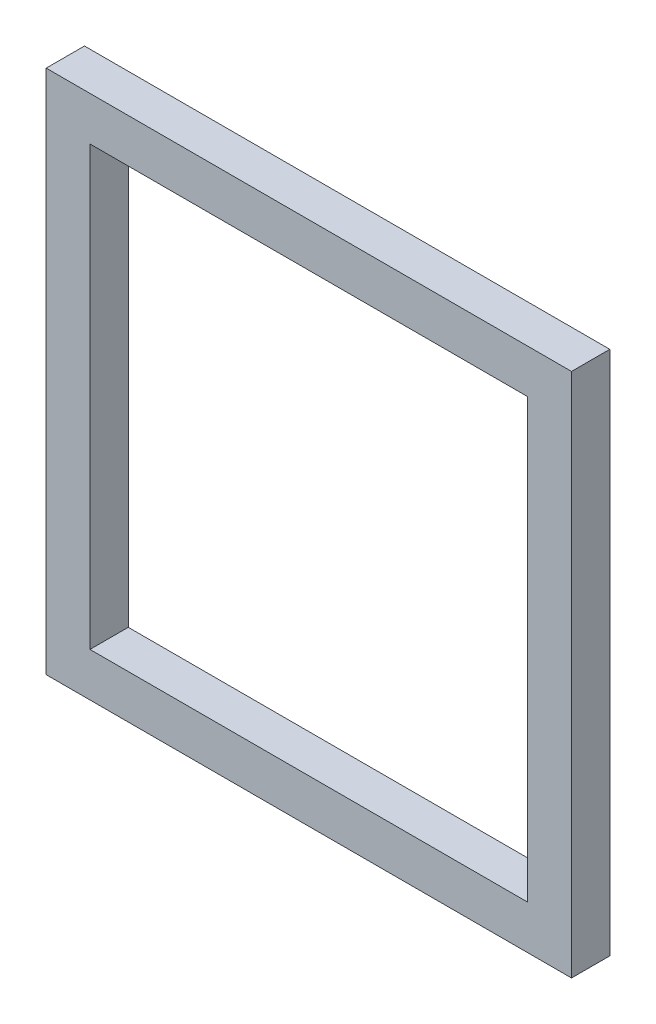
ISO-10303-21;
HEADER;
FILE_DESCRIPTION(('STEP AP214'),'2;1');
FILE_NAME('part.step','',(''),(''),'','','');
FILE_SCHEMA(('AUTOMOTIVE_DESIGN { 1 0 10303 214 1 1 1 1 }'));
ENDSEC;
DATA;
#1=APPLICATION_CONTEXT('core data for automotive mechanical design processes');
#2=APPLICATION_PROTOCOL_DEFINITION('international standard','automotive_design',2000,#1);
#3=PRODUCT_CONTEXT('',#1,'mechanical');
#4=PRODUCT('Part','Part','',(#3));
#5=PRODUCT_RELATED_PRODUCT_CATEGORY('part','',(#4));
#6=PRODUCT_DEFINITION_FORMATION('','',#4);
#7=PRODUCT_DEFINITION_CONTEXT('part definition',#1,'design');
#8=PRODUCT_DEFINITION('design','',#6,#7);
#9=PRODUCT_DEFINITION_SHAPE('','',#8);
#10=(LENGTH_UNIT() NAMED_UNIT(*) SI_UNIT(.MILLI.,.METRE.));
#11=(NAMED_UNIT(*) PLANE_ANGLE_UNIT() SI_UNIT($,.RADIAN.));
#12=(NAMED_UNIT(*) SI_UNIT($,.STERADIAN.) SOLID_ANGLE_UNIT());
#13=UNCERTAINTY_MEASURE_WITH_UNIT(LENGTH_MEASURE(1.E-05),#10,'distance_accuracy_value','');
#14=(GEOMETRIC_REPRESENTATION_CONTEXT(3) GLOBAL_UNCERTAINTY_ASSIGNED_CONTEXT((#13)) GLOBAL_UNIT_ASSIGNED_CONTEXT((#10,
#11,#12)) REPRESENTATION_CONTEXT('',''));
#15=CARTESIAN_POINT('',(0.,0.,0.));
#16=DIRECTION('',(0.,0.,1.));
#17=DIRECTION('',(1.,0.,0.));
#18=AXIS2_PLACEMENT_3D('',#15,#16,#17);
#19=CARTESIAN_POINT('',(700.,1000.,35.));
#20=DIRECTION('',(0.,-1.,0.));
#21=DIRECTION('',(0.,0.,-1.));
#22=AXIS2_PLACEMENT_3D('',#19,#20,#21);
#23=PLANE('',#22);
#24=CARTESIAN_POINT('',(300.,1000.,35.));
#25=DIRECTION('',(0.,0.,-1.));
#26=VECTOR('',#25,1.);
#27=LINE('',#24,#26);
#28=CARTESIAN_POINT('',(300.,1000.,35.));
#29=VERTEX_POINT('',#28);
#30=CARTESIAN_POINT('',(300.,1000.,0.));
#31=VERTEX_POINT('',#30);
#32=EDGE_CURVE('E12',#29,#31,#27,.T.);
#33=ORIENTED_EDGE('',*,*,#32,.F.);
#34=DIRECTION('',(-1.,0.,0.));
#35=VECTOR('',#34,1.);
#36=CARTESIAN_POINT('',(700.,1000.,35.));
#37=LINE('',#36,#35);
#38=CARTESIAN_POINT('',(700.,1000.,35.));
#39=VERTEX_POINT('',#38);
#40=EDGE_CURVE('E131',#39,#29,#37,.T.);
#41=ORIENTED_EDGE('',*,*,#40,.F.);
#42=DIRECTION('',(0.,0.,1.));
#43=VECTOR('',#42,1.);
#44=CARTESIAN_POINT('',(700.,1000.,35.));
#45=LINE('',#44,#43);
#46=CARTESIAN_POINT('',(700.,1000.,0.));
#47=VERTEX_POINT('',#46);
#48=EDGE_CURVE('E209',#47,#39,#45,.T.);
#49=ORIENTED_EDGE('',*,*,#48,.F.);
#50=DIRECTION('',(-1.,0.,0.));
#51=VECTOR('',#50,1.);
#52=CARTESIAN_POINT('',(700.,1000.,0.));
#53=LINE('',#52,#51);
#54=EDGE_CURVE('E124',#47,#31,#53,.T.);
#55=ORIENTED_EDGE('',*,*,#54,.T.);
#56=EDGE_LOOP('',(#33,#41,#49,#55));
#57=FACE_BOUND('',#56,.T.);
#58=ADVANCED_FACE('F36',(#57),#23,.F.);
#59=CARTESIAN_POINT('',(740.,960.,35.));
#60=DIRECTION('',(0.,1.,0.));
#61=DIRECTION('',(0.,0.,1.));
#62=AXIS2_PLACEMENT_3D('',#59,#60,#61);
#63=PLANE('',#62);
#64=CARTESIAN_POINT('',(260.,960.,0.));
#65=DIRECTION('',(0.,0.,1.));
#66=VECTOR('',#65,1.);
#67=LINE('',#64,#66);
#68=CARTESIAN_POINT('',(260.,960.,0.));
#69=VERTEX_POINT('',#68);
#70=CARTESIAN_POINT('',(260.,960.,35.));
#71=VERTEX_POINT('',#70);
#72=EDGE_CURVE('E46',#69,#71,#67,.T.);
#73=ORIENTED_EDGE('',*,*,#72,.F.);
#74=DIRECTION('',(-1.,0.,0.));
#75=VECTOR('',#74,1.);
#76=CARTESIAN_POINT('',(740.,960.,0.));
#77=LINE('',#76,#75);
#78=CARTESIAN_POINT('',(740.,960.,0.));
#79=VERTEX_POINT('',#78);
#80=EDGE_CURVE('E130',#79,#69,#77,.T.);
#81=ORIENTED_EDGE('',*,*,#80,.F.);
#82=DIRECTION('',(0.,0.,-1.));
#83=VECTOR('',#82,1.);
#84=CARTESIAN_POINT('',(740.,960.,35.));
#85=LINE('',#84,#83);
#86=CARTESIAN_POINT('',(740.,960.,35.));
#87=VERTEX_POINT('',#86);
#88=EDGE_CURVE('E128',#87,#79,#85,.T.);
#89=ORIENTED_EDGE('',*,*,#88,.F.);
#90=DIRECTION('',(-1.,0.,0.));
#91=VECTOR('',#90,1.);
#92=CARTESIAN_POINT('',(740.,960.,35.));
#93=LINE('',#92,#91);
#94=EDGE_CURVE('E107',#87,#71,#93,.T.);
#95=ORIENTED_EDGE('',*,*,#94,.T.);
#96=EDGE_LOOP('',(#73,#81,#89,#95));
#97=FACE_BOUND('',#96,.T.);
#98=ADVANCED_FACE('F38',(#97),#63,.F.);
#99=CARTESIAN_POINT('',(740.,1440.,35.));
#100=DIRECTION('',(1.,0.,0.));
#101=DIRECTION('',(0.,1.,0.));
#102=AXIS2_PLACEMENT_3D('',#99,#100,#101);
#103=PLANE('',#102);
#104=DIRECTION('',(0.,-1.,0.));
#105=VECTOR('',#104,1.);
#106=CARTESIAN_POINT('',(740.,1440.,35.));
#107=LINE('',#106,#105);
#108=CARTESIAN_POINT('',(740.,1440.,35.));
#109=VERTEX_POINT('',#108);
#110=EDGE_CURVE('E233',#109,#87,#107,.T.);
#111=ORIENTED_EDGE('',*,*,#110,.T.);
#112=ORIENTED_EDGE('',*,*,#88,.T.);
#113=DIRECTION('',(0.,-1.,0.));
#114=VECTOR('',#113,1.);
#115=CARTESIAN_POINT('',(740.,1440.,0.));
#116=LINE('',#115,#114);
#117=CARTESIAN_POINT('',(740.,1440.,0.));
#118=VERTEX_POINT('',#117);
#119=EDGE_CURVE('E230',#118,#79,#116,.T.);
#120=ORIENTED_EDGE('',*,*,#119,.F.);
#121=DIRECTION('',(0.,0.,1.));
#122=VECTOR('',#121,1.);
#123=CARTESIAN_POINT('',(740.,1440.,35.));
#124=LINE('',#123,#122);
#125=EDGE_CURVE('E237',#118,#109,#124,.T.);
#126=ORIENTED_EDGE('',*,*,#125,.T.);
#127=EDGE_LOOP('',(#111,#112,#120,#126));
#128=FACE_BOUND('',#127,.T.);
#129=ADVANCED_FACE('F183',(#128),#103,.T.);
#130=CARTESIAN_POINT('',(700.,1400.,35.));
#131=DIRECTION('',(-1.,0.,0.));
#132=DIRECTION('',(0.,-1.,0.));
#133=AXIS2_PLACEMENT_3D('',#130,#131,#132);
#134=PLANE('',#133);
#135=DIRECTION('',(0.,-1.,0.));
#136=VECTOR('',#135,1.);
#137=CARTESIAN_POINT('',(700.,1400.,0.));
#138=LINE('',#137,#136);
#139=CARTESIAN_POINT('',(700.,1400.,0.));
#140=VERTEX_POINT('',#139);
#141=EDGE_CURVE('E212',#140,#47,#138,.T.);
#142=ORIENTED_EDGE('',*,*,#141,.T.);
#143=ORIENTED_EDGE('',*,*,#48,.T.);
#144=DIRECTION('',(0.,-1.,0.));
#145=VECTOR('',#144,1.);
#146=CARTESIAN_POINT('',(700.,1400.,35.));
#147=LINE('',#146,#145);
#148=CARTESIAN_POINT('',(700.,1400.,35.));
#149=VERTEX_POINT('',#148);
#150=EDGE_CURVE('E225',#149,#39,#147,.T.);
#151=ORIENTED_EDGE('',*,*,#150,.F.);
#152=DIRECTION('',(0.,0.,-1.));
#153=VECTOR('',#152,1.);
#154=CARTESIAN_POINT('',(700.,1400.,35.));
#155=LINE('',#154,#153);
#156=EDGE_CURVE('E235',#149,#140,#155,.T.);
#157=ORIENTED_EDGE('',*,*,#156,.T.);
#158=EDGE_LOOP('',(#142,#143,#151,#157));
#159=FACE_BOUND('',#158,.T.);
#160=ADVANCED_FACE('F178',(#159),#134,.T.);
#161=CARTESIAN_POINT('',(260.,1440.,35.));
#162=DIRECTION('',(0.,-1.,0.));
#163=DIRECTION('',(0.,0.,-1.));
#164=AXIS2_PLACEMENT_3D('',#161,#162,#163);
#165=PLANE('',#164);
#166=ORIENTED_EDGE('',*,*,#125,.F.);
#167=DIRECTION('',(1.,0.,0.));
#168=VECTOR('',#167,1.);
#169=CARTESIAN_POINT('',(260.,1440.,0.));
#170=LINE('',#169,#168);
#171=CARTESIAN_POINT('',(260.,1440.,0.));
#172=VERTEX_POINT('',#171);
#173=EDGE_CURVE('E240',#172,#118,#170,.T.);
#174=ORIENTED_EDGE('',*,*,#173,.F.);
#175=DIRECTION('',(0.,0.,-1.));
#176=VECTOR('',#175,1.);
#177=CARTESIAN_POINT('',(260.,1440.,35.));
#178=LINE('',#177,#176);
#179=CARTESIAN_POINT('',(260.,1440.,35.));
#180=VERTEX_POINT('',#179);
#181=EDGE_CURVE('E114',#180,#172,#178,.T.);
#182=ORIENTED_EDGE('',*,*,#181,.F.);
#183=DIRECTION('',(1.,0.,0.));
#184=VECTOR('',#183,1.);
#185=CARTESIAN_POINT('',(260.,1440.,35.));
#186=LINE('',#185,#184);
#187=EDGE_CURVE('E110',#180,#109,#186,.T.);
#188=ORIENTED_EDGE('',*,*,#187,.T.);
#189=EDGE_LOOP('',(#166,#174,#182,#188));
#190=FACE_BOUND('',#189,.T.);
#191=ADVANCED_FACE('F167',(#190),#165,.F.);
#192=CARTESIAN_POINT('',(300.,1400.,35.));
#193=DIRECTION('',(0.,1.,0.));
#194=DIRECTION('',(0.,0.,1.));
#195=AXIS2_PLACEMENT_3D('',#192,#193,#194);
#196=PLANE('',#195);
#197=ORIENTED_EDGE('',*,*,#156,.F.);
#198=DIRECTION('',(1.,0.,0.));
#199=VECTOR('',#198,1.);
#200=CARTESIAN_POINT('',(300.,1400.,35.));
#201=LINE('',#200,#199);
#202=CARTESIAN_POINT('',(300.,1400.,35.));
#203=VERTEX_POINT('',#202);
#204=EDGE_CURVE('E223',#203,#149,#201,.T.);
#205=ORIENTED_EDGE('',*,*,#204,.F.);
#206=DIRECTION('',(0.,0.,1.));
#207=VECTOR('',#206,1.);
#208=CARTESIAN_POINT('',(300.,1400.,35.));
#209=LINE('',#208,#207);
#210=CARTESIAN_POINT('',(300.,1400.,0.));
#211=VERTEX_POINT('',#210);
#212=EDGE_CURVE('E218',#211,#203,#209,.T.);
#213=ORIENTED_EDGE('',*,*,#212,.F.);
#214=DIRECTION('',(1.,0.,0.));
#215=VECTOR('',#214,1.);
#216=CARTESIAN_POINT('',(300.,1400.,0.));
#217=LINE('',#216,#215);
#218=EDGE_CURVE('E215',#211,#140,#217,.T.);
#219=ORIENTED_EDGE('',*,*,#218,.T.);
#220=EDGE_LOOP('',(#197,#205,#213,#219));
#221=FACE_BOUND('',#220,.T.);
#222=ADVANCED_FACE('F177',(#221),#196,.F.);
#223=CARTESIAN_POINT('',(260.,1546.30145812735,35.));
#224=DIRECTION('',(0.,0.,1.));
#225=DIRECTION('',(1.,0.,0.));
#226=AXIS2_PLACEMENT_3D('',#223,#224,#225);
#227=PLANE('',#226);
#228=ORIENTED_EDGE('',*,*,#187,.F.);
#229=DIRECTION('',(0.,-1.,0.));
#230=VECTOR('',#229,1.);
#231=CARTESIAN_POINT('',(260.,1546.30145812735,35.));
#232=LINE('',#231,#230);
#233=EDGE_CURVE('E102',#180,#71,#232,.T.);
#234=ORIENTED_EDGE('',*,*,#233,.T.);
#235=ORIENTED_EDGE('',*,*,#94,.F.);
#236=ORIENTED_EDGE('',*,*,#110,.F.);
#237=EDGE_LOOP('',(#228,#234,#235,#236));
#238=FACE_BOUND('',#237,.T.);
#239=DIRECTION('',(0.,-1.,0.));
#240=VECTOR('',#239,1.);
#241=CARTESIAN_POINT('',(300.,1546.30145812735,35.));
#242=LINE('',#241,#240);
#243=EDGE_CURVE('E115',#203,#29,#242,.T.);
#244=ORIENTED_EDGE('',*,*,#243,.F.);
#245=ORIENTED_EDGE('',*,*,#204,.T.);
#246=ORIENTED_EDGE('',*,*,#150,.T.);
#247=ORIENTED_EDGE('',*,*,#40,.T.);
#248=EDGE_LOOP('',(#244,#245,#246,#247));
#249=FACE_BOUND('',#248,.T.);
#250=ADVANCED_FACE('F104',(#238,#249),#227,.T.);
#251=CARTESIAN_POINT('',(300.,1546.30145812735,35.));
#252=DIRECTION('',(1.,0.,0.));
#253=DIRECTION('',(0.,1.,0.));
#254=AXIS2_PLACEMENT_3D('',#251,#252,#253);
#255=PLANE('',#254);
#256=DIRECTION('',(0.,-1.,0.));
#257=VECTOR('',#256,1.);
#258=CARTESIAN_POINT('',(300.,1546.30145812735,0.));
#259=LINE('',#258,#257);
#260=EDGE_CURVE('E141',#211,#31,#259,.T.);
#261=ORIENTED_EDGE('',*,*,#260,.F.);
#262=ORIENTED_EDGE('',*,*,#212,.T.);
#263=ORIENTED_EDGE('',*,*,#243,.T.);
#264=ORIENTED_EDGE('',*,*,#32,.T.);
#265=EDGE_LOOP('',(#261,#262,#263,#264));
#266=FACE_BOUND('',#265,.T.);
#267=ADVANCED_FACE('F150',(#266),#255,.T.);
#268=CARTESIAN_POINT('',(260.,1546.30145812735,0.));
#269=DIRECTION('',(0.,0.,-1.));
#270=DIRECTION('',(-1.,0.,0.));
#271=AXIS2_PLACEMENT_3D('',#268,#269,#270);
#272=PLANE('',#271);
#273=ORIENTED_EDGE('',*,*,#218,.F.);
#274=ORIENTED_EDGE('',*,*,#260,.T.);
#275=ORIENTED_EDGE('',*,*,#54,.F.);
#276=ORIENTED_EDGE('',*,*,#141,.F.);
#277=EDGE_LOOP('',(#273,#274,#275,#276));
#278=FACE_BOUND('',#277,.T.);
#279=DIRECTION('',(0.,-1.,0.));
#280=VECTOR('',#279,1.);
#281=CARTESIAN_POINT('',(260.,1546.30145812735,0.));
#282=LINE('',#281,#280);
#283=EDGE_CURVE('E120',#172,#69,#282,.T.);
#284=ORIENTED_EDGE('',*,*,#283,.F.);
#285=ORIENTED_EDGE('',*,*,#173,.T.);
#286=ORIENTED_EDGE('',*,*,#119,.T.);
#287=ORIENTED_EDGE('',*,*,#80,.T.);
#288=EDGE_LOOP('',(#284,#285,#286,#287));
#289=FACE_BOUND('',#288,.T.);
#290=ADVANCED_FACE('F160',(#278,#289),#272,.T.);
#291=CARTESIAN_POINT('',(260.,1546.30145812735,35.));
#292=DIRECTION('',(-1.,0.,0.));
#293=DIRECTION('',(0.,-1.,0.));
#294=AXIS2_PLACEMENT_3D('',#291,#292,#293);
#295=PLANE('',#294);
#296=ORIENTED_EDGE('',*,*,#233,.F.);
#297=ORIENTED_EDGE('',*,*,#181,.T.);
#298=ORIENTED_EDGE('',*,*,#283,.T.);
#299=ORIENTED_EDGE('',*,*,#72,.T.);
#300=EDGE_LOOP('',(#296,#297,#298,#299));
#301=FACE_BOUND('',#300,.T.);
#302=ADVANCED_FACE('F118',(#301),#295,.T.);
#303=CLOSED_SHELL('',(#58,#98,#129,#160,#191,#222,#250,#267,#290,#302));
#304=MANIFOLD_SOLID_BREP('B2',#303);
#305=ADVANCED_BREP_SHAPE_REPRESENTATION('',(#18,#304),#14);
#306=SHAPE_DEFINITION_REPRESENTATION(#9,#305);
ENDSEC;
END-ISO-10303-21;
